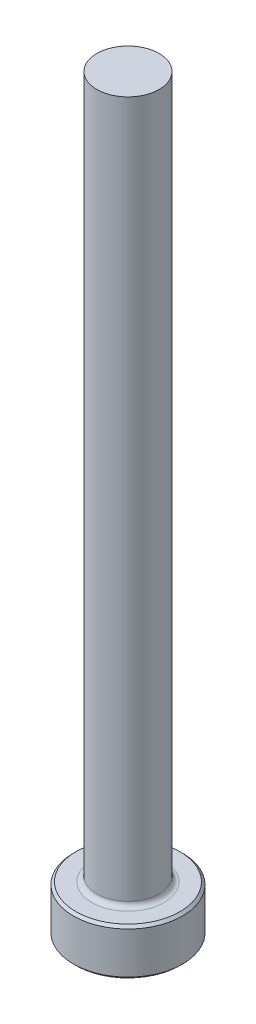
from build123d import *

# Parameters (mm, degrees)
CHAMFER1_SIZE = 0.254
FILLET1_R     = 0.508


with BuildPart() as part:
    # Sketch1 → Revolve1 (revolve)
    with BuildSketch(Plane.XY, mode=Mode.PRIVATE) as revolve1_sk:
        Polygon((0, 0), (-5.5499, 0), (-5.5499, 4.7498), (-3.175, 4.7498), (-3.175, 76.2), (0, 76.2), align=None)
    revolve(revolve1_sk.sketch.rotate(Axis((0, 259.958771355, 0), (0, -1, 0)), 270), axis=Axis((0, 259.958771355, 0), (0, -1, 0)))

    # Chamfer1
    chamfer1_edges = [part.edges().sort_by_distance(p)[0] for p in [
        (0, 4.7498, -5.5499),
        (0, 0, -5.5499),
    ]]
    chamfer(chamfer1_edges, length=CHAMFER1_SIZE)

    # Fillet1
    fillet1_edges = [part.edges().sort_by_distance(p)[0] for p in [
        (0, 4.7498, -3.175),
    ]]
    fillet(fillet1_edges, radius=FILLET1_R)


solid = part.part
